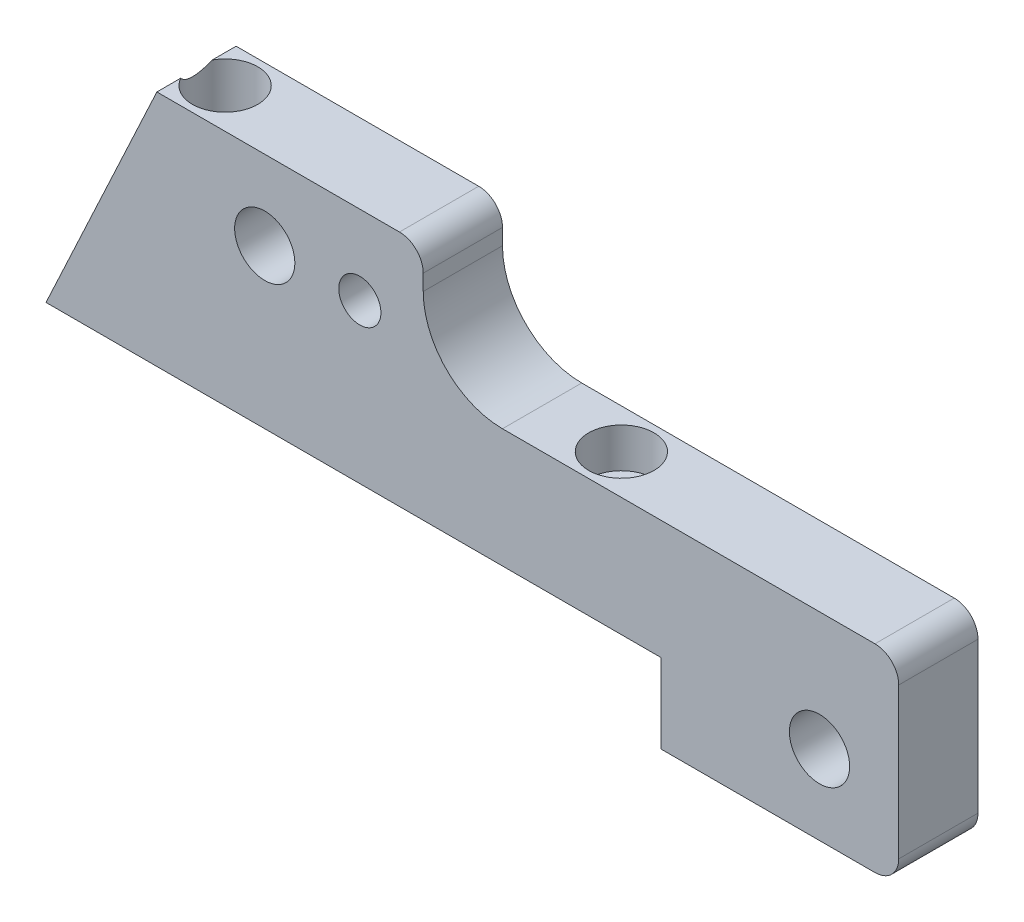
ISO-10303-21;
HEADER;
FILE_DESCRIPTION(('STEP AP214'),'2;1');
FILE_NAME('part.step','',(''),(''),'','','');
FILE_SCHEMA(('AUTOMOTIVE_DESIGN { 1 0 10303 214 1 1 1 1 }'));
ENDSEC;
DATA;
#1=APPLICATION_CONTEXT('core data for automotive mechanical design processes');
#2=APPLICATION_PROTOCOL_DEFINITION('international standard','automotive_design',2000,#1);
#3=PRODUCT_CONTEXT('',#1,'mechanical');
#4=PRODUCT('Part','Part','',(#3));
#5=PRODUCT_RELATED_PRODUCT_CATEGORY('part','',(#4));
#6=PRODUCT_DEFINITION_FORMATION('','',#4);
#7=PRODUCT_DEFINITION_CONTEXT('part definition',#1,'design');
#8=PRODUCT_DEFINITION('design','',#6,#7);
#9=PRODUCT_DEFINITION_SHAPE('','',#8);
#10=(LENGTH_UNIT() NAMED_UNIT(*) SI_UNIT(.MILLI.,.METRE.));
#11=(NAMED_UNIT(*) PLANE_ANGLE_UNIT() SI_UNIT($,.RADIAN.));
#12=(NAMED_UNIT(*) SI_UNIT($,.STERADIAN.) SOLID_ANGLE_UNIT());
#13=UNCERTAINTY_MEASURE_WITH_UNIT(LENGTH_MEASURE(1.E-05),#10,'distance_accuracy_value','');
#14=(GEOMETRIC_REPRESENTATION_CONTEXT(3) GLOBAL_UNCERTAINTY_ASSIGNED_CONTEXT((#13)) GLOBAL_UNIT_ASSIGNED_CONTEXT((#10,
#11,#12)) REPRESENTATION_CONTEXT('',''));
#15=CARTESIAN_POINT('',(0.,0.,0.));
#16=DIRECTION('',(0.,0.,1.));
#17=DIRECTION('',(1.,0.,0.));
#18=AXIS2_PLACEMENT_3D('',#15,#16,#17);
#19=CARTESIAN_POINT('',(-41.91,34.29,6.35));
#20=DIRECTION('',(0.,0.,-1.));
#21=DIRECTION('',(-1.,0.,0.));
#22=AXIS2_PLACEMENT_3D('',#19,#20,#21);
#23=PLANE('',#22);
#24=CARTESIAN_POINT('',(-48.26,25.4,6.35));
#25=DIRECTION('',(0.,0.,-1.));
#26=DIRECTION('',(-1.,0.,0.));
#27=AXIS2_PLACEMENT_3D('',#24,#25,#26);
#28=CIRCLE('',#27,3.3782);
#29=CARTESIAN_POINT('',(-51.6382,25.4,6.35));
#30=VERTEX_POINT('',#29);
#31=EDGE_CURVE('E48',#30,#30,#28,.T.);
#32=ORIENTED_EDGE('',*,*,#31,.T.);
#33=EDGE_LOOP('',(#32));
#34=FACE_BOUND('',#33,.T.);
#35=DIRECTION('',(0.,-1.,0.));
#36=VECTOR('',#35,1.);
#37=CARTESIAN_POINT('',(0.,-12.7,6.35));
#38=LINE('',#37,#36);
#39=CARTESIAN_POINT('',(0.,0.,6.35));
#40=VERTEX_POINT('',#39);
#41=CARTESIAN_POINT('',(0.,-12.7,6.35));
#42=VERTEX_POINT('',#41);
#43=EDGE_CURVE('E201',#40,#42,#38,.T.);
#44=ORIENTED_EDGE('',*,*,#43,.T.);
#45=DIRECTION('',(1.,0.,0.));
#46=VECTOR('',#45,1.);
#47=CARTESIAN_POINT('',(34.29,-12.7,6.35));
#48=LINE('',#47,#46);
#49=CARTESIAN_POINT('',(34.29,-12.7,6.35));
#50=VERTEX_POINT('',#49);
#51=EDGE_CURVE('E122',#42,#50,#48,.T.);
#52=ORIENTED_EDGE('',*,*,#51,.T.);
#53=CARTESIAN_POINT('',(34.29,-8.89,6.35));
#54=DIRECTION('',(0.,0.,1.));
#55=DIRECTION('',(-1.,0.,0.));
#56=AXIS2_PLACEMENT_3D('',#53,#54,#55);
#57=CIRCLE('',#56,3.81);
#58=CARTESIAN_POINT('',(38.1,-8.89,6.35));
#59=VERTEX_POINT('',#58);
#60=EDGE_CURVE('E264',#50,#59,#57,.T.);
#61=ORIENTED_EDGE('',*,*,#60,.T.);
#62=DIRECTION('',(0.,1.,0.));
#63=VECTOR('',#62,1.);
#64=CARTESIAN_POINT('',(38.1,15.24,6.35));
#65=LINE('',#64,#63);
#66=CARTESIAN_POINT('',(38.1,15.24,6.35));
#67=VERTEX_POINT('',#66);
#68=EDGE_CURVE('E266',#59,#67,#65,.T.);
#69=ORIENTED_EDGE('',*,*,#68,.T.);
#70=CARTESIAN_POINT('',(34.29,15.24,6.35));
#71=DIRECTION('',(0.,0.,1.));
#72=DIRECTION('',(-1.,0.,0.));
#73=AXIS2_PLACEMENT_3D('',#70,#71,#72);
#74=CIRCLE('',#73,3.81);
#75=CARTESIAN_POINT('',(34.29,19.05,6.35));
#76=VERTEX_POINT('',#75);
#77=EDGE_CURVE('E268',#67,#76,#74,.T.);
#78=ORIENTED_EDGE('',*,*,#77,.T.);
#79=DIRECTION('',(-1.,0.,0.));
#80=VECTOR('',#79,1.);
#81=CARTESIAN_POINT('',(-25.4,19.05,6.35));
#82=LINE('',#81,#80);
#83=CARTESIAN_POINT('',(-25.4,19.05,6.35));
#84=VERTEX_POINT('',#83);
#85=EDGE_CURVE('E270',#76,#84,#82,.T.);
#86=ORIENTED_EDGE('',*,*,#85,.T.);
#87=CARTESIAN_POINT('',(-25.4,31.75,6.35));
#88=DIRECTION('',(0.,0.,-1.));
#89=DIRECTION('',(1.,0.,0.));
#90=AXIS2_PLACEMENT_3D('',#87,#88,#89);
#91=CIRCLE('',#90,12.7);
#92=CARTESIAN_POINT('',(-38.1,31.75,6.35));
#93=VERTEX_POINT('',#92);
#94=EDGE_CURVE('E272',#84,#93,#91,.T.);
#95=ORIENTED_EDGE('',*,*,#94,.T.);
#96=DIRECTION('',(0.,1.,0.));
#97=VECTOR('',#96,1.);
#98=CARTESIAN_POINT('',(-38.1,34.29,6.35));
#99=LINE('',#98,#97);
#100=CARTESIAN_POINT('',(-38.1,34.29,6.35));
#101=VERTEX_POINT('',#100);
#102=EDGE_CURVE('E274',#93,#101,#99,.T.);
#103=ORIENTED_EDGE('',*,*,#102,.T.);
#104=CARTESIAN_POINT('',(-41.91,34.29,6.35));
#105=DIRECTION('',(0.,0.,1.));
#106=DIRECTION('',(-1.,0.,0.));
#107=AXIS2_PLACEMENT_3D('',#104,#105,#106);
#108=CIRCLE('',#107,3.81);
#109=CARTESIAN_POINT('',(-41.91,38.1,6.35));
#110=VERTEX_POINT('',#109);
#111=EDGE_CURVE('E155',#101,#110,#108,.T.);
#112=ORIENTED_EDGE('',*,*,#111,.T.);
#113=DIRECTION('',(-1.,0.,0.));
#114=VECTOR('',#113,1.);
#115=CARTESIAN_POINT('',(-80.7856782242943,38.1,6.35));
#116=LINE('',#115,#114);
#117=CARTESIAN_POINT('',(-80.7856782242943,38.1,6.35));
#118=VERTEX_POINT('',#117);
#119=EDGE_CURVE('E148',#110,#118,#116,.T.);
#120=ORIENTED_EDGE('',*,*,#119,.T.);
#121=DIRECTION('',(-0.422618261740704,-0.906307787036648,0.));
#122=VECTOR('',#121,1.);
#123=CARTESIAN_POINT('',(-98.552,0.,6.35));
#124=LINE('',#123,#122);
#125=CARTESIAN_POINT('',(-98.552,0.,6.35));
#126=VERTEX_POINT('',#125);
#127=EDGE_CURVE('E152',#118,#126,#124,.T.);
#128=ORIENTED_EDGE('',*,*,#127,.T.);
#129=DIRECTION('',(1.,0.,0.));
#130=VECTOR('',#129,1.);
#131=CARTESIAN_POINT('',(0.,0.,6.35));
#132=LINE('',#131,#130);
#133=EDGE_CURVE('E68',#126,#40,#132,.T.);
#134=ORIENTED_EDGE('',*,*,#133,.T.);
#135=EDGE_LOOP('',(#44,#52,#61,#69,#78,#86,#95,#103,#112,#120,#128,#134));
#136=FACE_BOUND('',#135,.T.);
#137=CARTESIAN_POINT('',(-63.5,25.4,6.35));
#138=DIRECTION('',(0.,0.,1.));
#139=DIRECTION('',(1.,0.,0.));
#140=AXIS2_PLACEMENT_3D('',#137,#138,#139);
#141=CIRCLE('',#140,4.826);
#142=CARTESIAN_POINT('',(-58.674,25.4,6.35));
#143=VERTEX_POINT('',#142);
#144=EDGE_CURVE('E179',#143,#143,#141,.T.);
#145=ORIENTED_EDGE('',*,*,#144,.F.);
#146=EDGE_LOOP('',(#145));
#147=FACE_BOUND('',#146,.T.);
#148=CARTESIAN_POINT('',(25.4,0.,6.35));
#149=DIRECTION('',(0.,0.,1.));
#150=DIRECTION('',(1.,0.,0.));
#151=AXIS2_PLACEMENT_3D('',#148,#149,#150);
#152=CIRCLE('',#151,4.826);
#153=CARTESIAN_POINT('',(30.226,0.,6.35));
#154=VERTEX_POINT('',#153);
#155=EDGE_CURVE('E252',#154,#154,#152,.T.);
#156=ORIENTED_EDGE('',*,*,#155,.F.);
#157=EDGE_LOOP('',(#156));
#158=FACE_BOUND('',#157,.T.);
#159=ADVANCED_FACE('F44',(#34,#136,#147,#158),#23,.F.);
#160=CARTESIAN_POINT('',(-41.91,34.29,-6.35));
#161=DIRECTION('',(0.,0.,-1.));
#162=DIRECTION('',(-1.,0.,0.));
#163=AXIS2_PLACEMENT_3D('',#160,#161,#162);
#164=PLANE('',#163);
#165=CARTESIAN_POINT('',(-48.26,25.4,-6.35));
#166=DIRECTION('',(0.,0.,-1.));
#167=DIRECTION('',(-1.,0.,0.));
#168=AXIS2_PLACEMENT_3D('',#165,#166,#167);
#169=CIRCLE('',#168,6.74623999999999);
#170=CARTESIAN_POINT('',(-55.00624,25.4,-6.35));
#171=VERTEX_POINT('',#170);
#172=EDGE_CURVE('E548',#171,#171,#169,.T.);
#173=ORIENTED_EDGE('',*,*,#172,.F.);
#174=EDGE_LOOP('',(#173));
#175=FACE_BOUND('',#174,.T.);
#176=CARTESIAN_POINT('',(-63.5,25.4,-6.35));
#177=DIRECTION('',(0.,0.,1.));
#178=DIRECTION('',(1.,0.,0.));
#179=AXIS2_PLACEMENT_3D('',#176,#177,#178);
#180=CIRCLE('',#179,4.826);
#181=CARTESIAN_POINT('',(-58.674,25.4,-6.35));
#182=VERTEX_POINT('',#181);
#183=EDGE_CURVE('E255',#182,#182,#180,.T.);
#184=ORIENTED_EDGE('',*,*,#183,.T.);
#185=EDGE_LOOP('',(#184));
#186=FACE_BOUND('',#185,.T.);
#187=DIRECTION('',(0.,-1.,0.));
#188=VECTOR('',#187,1.);
#189=CARTESIAN_POINT('',(0.,-12.7,-6.35));
#190=LINE('',#189,#188);
#191=CARTESIAN_POINT('',(0.,0.,-6.35));
#192=VERTEX_POINT('',#191);
#193=CARTESIAN_POINT('',(0.,-12.7,-6.35));
#194=VERTEX_POINT('',#193);
#195=EDGE_CURVE('E175',#192,#194,#190,.T.);
#196=ORIENTED_EDGE('',*,*,#195,.F.);
#197=DIRECTION('',(1.,0.,0.));
#198=VECTOR('',#197,1.);
#199=CARTESIAN_POINT('',(0.,0.,-6.35));
#200=LINE('',#199,#198);
#201=CARTESIAN_POINT('',(-98.552,0.,-6.35));
#202=VERTEX_POINT('',#201);
#203=EDGE_CURVE('E113',#202,#192,#200,.T.);
#204=ORIENTED_EDGE('',*,*,#203,.F.);
#205=DIRECTION('',(-0.422618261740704,-0.906307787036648,0.));
#206=VECTOR('',#205,1.);
#207=CARTESIAN_POINT('',(-98.552,0.,-6.35));
#208=LINE('',#207,#206);
#209=CARTESIAN_POINT('',(-80.7856782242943,38.1,-6.35));
#210=VERTEX_POINT('',#209);
#211=EDGE_CURVE('E198',#210,#202,#208,.T.);
#212=ORIENTED_EDGE('',*,*,#211,.F.);
#213=DIRECTION('',(-1.,0.,0.));
#214=VECTOR('',#213,1.);
#215=CARTESIAN_POINT('',(-80.7856782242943,38.1,-6.35));
#216=LINE('',#215,#214);
#217=CARTESIAN_POINT('',(-41.91,38.1,-6.35));
#218=VERTEX_POINT('',#217);
#219=EDGE_CURVE('E195',#218,#210,#216,.T.);
#220=ORIENTED_EDGE('',*,*,#219,.F.);
#221=CARTESIAN_POINT('',(-41.91,34.29,-6.35));
#222=DIRECTION('',(0.,0.,1.));
#223=DIRECTION('',(-1.,0.,0.));
#224=AXIS2_PLACEMENT_3D('',#221,#222,#223);
#225=CIRCLE('',#224,3.81);
#226=CARTESIAN_POINT('',(-38.1,34.29,-6.35));
#227=VERTEX_POINT('',#226);
#228=EDGE_CURVE('E193',#227,#218,#225,.T.);
#229=ORIENTED_EDGE('',*,*,#228,.F.);
#230=DIRECTION('',(0.,1.,0.));
#231=VECTOR('',#230,1.);
#232=CARTESIAN_POINT('',(-38.1,34.29,-6.35));
#233=LINE('',#232,#231);
#234=CARTESIAN_POINT('',(-38.1,31.75,-6.35));
#235=VERTEX_POINT('',#234);
#236=EDGE_CURVE('E191',#235,#227,#233,.T.);
#237=ORIENTED_EDGE('',*,*,#236,.F.);
#238=CARTESIAN_POINT('',(-25.4,31.75,-6.35));
#239=DIRECTION('',(0.,0.,-1.));
#240=DIRECTION('',(1.,0.,0.));
#241=AXIS2_PLACEMENT_3D('',#238,#239,#240);
#242=CIRCLE('',#241,12.7);
#243=CARTESIAN_POINT('',(-25.4,19.05,-6.35));
#244=VERTEX_POINT('',#243);
#245=EDGE_CURVE('E189',#244,#235,#242,.T.);
#246=ORIENTED_EDGE('',*,*,#245,.F.);
#247=DIRECTION('',(-1.,0.,0.));
#248=VECTOR('',#247,1.);
#249=CARTESIAN_POINT('',(-25.4,19.05,-6.35));
#250=LINE('',#249,#248);
#251=CARTESIAN_POINT('',(34.29,19.05,-6.35));
#252=VERTEX_POINT('',#251);
#253=EDGE_CURVE('E187',#252,#244,#250,.T.);
#254=ORIENTED_EDGE('',*,*,#253,.F.);
#255=CARTESIAN_POINT('',(34.29,15.24,-6.35));
#256=DIRECTION('',(0.,0.,1.));
#257=DIRECTION('',(-1.,0.,0.));
#258=AXIS2_PLACEMENT_3D('',#255,#256,#257);
#259=CIRCLE('',#258,3.81);
#260=CARTESIAN_POINT('',(38.1,15.24,-6.35));
#261=VERTEX_POINT('',#260);
#262=EDGE_CURVE('E185',#261,#252,#259,.T.);
#263=ORIENTED_EDGE('',*,*,#262,.F.);
#264=DIRECTION('',(0.,1.,0.));
#265=VECTOR('',#264,1.);
#266=CARTESIAN_POINT('',(38.1,15.24,-6.35));
#267=LINE('',#266,#265);
#268=CARTESIAN_POINT('',(38.1,-8.89,-6.35));
#269=VERTEX_POINT('',#268);
#270=EDGE_CURVE('E183',#269,#261,#267,.T.);
#271=ORIENTED_EDGE('',*,*,#270,.F.);
#272=CARTESIAN_POINT('',(34.29,-8.89,-6.35));
#273=DIRECTION('',(0.,0.,1.));
#274=DIRECTION('',(-1.,0.,0.));
#275=AXIS2_PLACEMENT_3D('',#272,#273,#274);
#276=CIRCLE('',#275,3.81);
#277=CARTESIAN_POINT('',(34.29,-12.7,-6.35));
#278=VERTEX_POINT('',#277);
#279=EDGE_CURVE('E181',#278,#269,#276,.T.);
#280=ORIENTED_EDGE('',*,*,#279,.F.);
#281=DIRECTION('',(1.,0.,0.));
#282=VECTOR('',#281,1.);
#283=CARTESIAN_POINT('',(34.29,-12.7,-6.35));
#284=LINE('',#283,#282);
#285=EDGE_CURVE('E178',#194,#278,#284,.T.);
#286=ORIENTED_EDGE('',*,*,#285,.F.);
#287=EDGE_LOOP('',(#196,#204,#212,#220,#229,#237,#246,#254,#263,#271,#280,#286));
#288=FACE_BOUND('',#287,.T.);
#289=CARTESIAN_POINT('',(25.4,0.,-6.35));
#290=DIRECTION('',(0.,0.,1.));
#291=DIRECTION('',(1.,0.,0.));
#292=AXIS2_PLACEMENT_3D('',#289,#290,#291);
#293=CIRCLE('',#292,4.826);
#294=CARTESIAN_POINT('',(30.226,0.,-6.35));
#295=VERTEX_POINT('',#294);
#296=EDGE_CURVE('E229',#295,#295,#293,.T.);
#297=ORIENTED_EDGE('',*,*,#296,.T.);
#298=EDGE_LOOP('',(#297));
#299=FACE_BOUND('',#298,.T.);
#300=ADVANCED_FACE('F289',(#175,#186,#288,#299),#164,.T.);
#301=CARTESIAN_POINT('',(0.,-12.7,6.35));
#302=DIRECTION('',(1.,0.,0.));
#303=DIRECTION('',(0.,0.,-1.));
#304=AXIS2_PLACEMENT_3D('',#301,#302,#303);
#305=PLANE('',#304);
#306=ORIENTED_EDGE('',*,*,#195,.T.);
#307=DIRECTION('',(0.,0.,-1.));
#308=VECTOR('',#307,1.);
#309=CARTESIAN_POINT('',(0.,-12.7,6.35));
#310=LINE('',#309,#308);
#311=EDGE_CURVE('E53',#42,#194,#310,.T.);
#312=ORIENTED_EDGE('',*,*,#311,.F.);
#313=ORIENTED_EDGE('',*,*,#43,.F.);
#314=DIRECTION('',(0.,0.,-1.));
#315=VECTOR('',#314,1.);
#316=CARTESIAN_POINT('',(0.,0.,6.35));
#317=LINE('',#316,#315);
#318=EDGE_CURVE('E171',#40,#192,#317,.T.);
#319=ORIENTED_EDGE('',*,*,#318,.T.);
#320=EDGE_LOOP('',(#306,#312,#313,#319));
#321=FACE_BOUND('',#320,.T.);
#322=ADVANCED_FACE('F46',(#321),#305,.F.);
#323=CARTESIAN_POINT('',(34.29,-12.7,6.35));
#324=DIRECTION('',(0.,1.,0.));
#325=DIRECTION('',(-1.,0.,0.));
#326=AXIS2_PLACEMENT_3D('',#323,#324,#325);
#327=PLANE('',#326);
#328=ORIENTED_EDGE('',*,*,#285,.T.);
#329=DIRECTION('',(0.,0.,-1.));
#330=VECTOR('',#329,1.);
#331=CARTESIAN_POINT('',(34.29,-12.7,6.35));
#332=LINE('',#331,#330);
#333=EDGE_CURVE('E223',#50,#278,#332,.T.);
#334=ORIENTED_EDGE('',*,*,#333,.F.);
#335=ORIENTED_EDGE('',*,*,#51,.F.);
#336=ORIENTED_EDGE('',*,*,#311,.T.);
#337=EDGE_LOOP('',(#328,#334,#335,#336));
#338=FACE_BOUND('',#337,.T.);
#339=ADVANCED_FACE('F297',(#338),#327,.F.);
#340=CARTESIAN_POINT('',(34.29,-8.89,6.35));
#341=DIRECTION('',(0.,0.,-1.));
#342=DIRECTION('',(-1.,0.,0.));
#343=AXIS2_PLACEMENT_3D('',#340,#341,#342);
#344=CYLINDRICAL_SURFACE('',#343,3.81);
#345=ORIENTED_EDGE('',*,*,#279,.T.);
#346=DIRECTION('',(0.,0.,-1.));
#347=VECTOR('',#346,1.);
#348=CARTESIAN_POINT('',(38.1,-8.89,6.35));
#349=LINE('',#348,#347);
#350=EDGE_CURVE('E220',#59,#269,#349,.T.);
#351=ORIENTED_EDGE('',*,*,#350,.F.);
#352=ORIENTED_EDGE('',*,*,#60,.F.);
#353=ORIENTED_EDGE('',*,*,#333,.T.);
#354=EDGE_LOOP('',(#345,#351,#352,#353));
#355=FACE_BOUND('',#354,.T.);
#356=ADVANCED_FACE('F300',(#355),#344,.T.);
#357=CARTESIAN_POINT('',(38.1,15.24,6.35));
#358=DIRECTION('',(-1.,0.,0.));
#359=DIRECTION('',(0.,-1.,0.));
#360=AXIS2_PLACEMENT_3D('',#357,#358,#359);
#361=PLANE('',#360);
#362=ORIENTED_EDGE('',*,*,#270,.T.);
#363=DIRECTION('',(0.,0.,-1.));
#364=VECTOR('',#363,1.);
#365=CARTESIAN_POINT('',(38.1,15.24,6.35));
#366=LINE('',#365,#364);
#367=EDGE_CURVE('E217',#67,#261,#366,.T.);
#368=ORIENTED_EDGE('',*,*,#367,.F.);
#369=ORIENTED_EDGE('',*,*,#68,.F.);
#370=ORIENTED_EDGE('',*,*,#350,.T.);
#371=EDGE_LOOP('',(#362,#368,#369,#370));
#372=FACE_BOUND('',#371,.T.);
#373=ADVANCED_FACE('F305',(#372),#361,.F.);
#374=CARTESIAN_POINT('',(34.29,15.24,6.35));
#375=DIRECTION('',(0.,0.,-1.));
#376=DIRECTION('',(-1.,0.,0.));
#377=AXIS2_PLACEMENT_3D('',#374,#375,#376);
#378=CYLINDRICAL_SURFACE('',#377,3.81);
#379=ORIENTED_EDGE('',*,*,#262,.T.);
#380=DIRECTION('',(0.,0.,-1.));
#381=VECTOR('',#380,1.);
#382=CARTESIAN_POINT('',(34.29,19.05,6.35));
#383=LINE('',#382,#381);
#384=EDGE_CURVE('E214',#76,#252,#383,.T.);
#385=ORIENTED_EDGE('',*,*,#384,.F.);
#386=ORIENTED_EDGE('',*,*,#77,.F.);
#387=ORIENTED_EDGE('',*,*,#367,.T.);
#388=EDGE_LOOP('',(#379,#385,#386,#387));
#389=FACE_BOUND('',#388,.T.);
#390=ADVANCED_FACE('F311',(#389),#378,.T.);
#391=CARTESIAN_POINT('',(-25.4,19.05,6.35));
#392=DIRECTION('',(0.,-1.,0.));
#393=DIRECTION('',(1.,0.,0.));
#394=AXIS2_PLACEMENT_3D('',#391,#392,#393);
#395=PLANE('',#394);
#396=CARTESIAN_POINT('',(-12.7,19.05,0.));
#397=DIRECTION('',(0.,1.,0.));
#398=DIRECTION('',(0.,0.,1.));
#399=AXIS2_PLACEMENT_3D('',#396,#397,#398);
#400=CIRCLE('',#399,5.23239999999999);
#401=CARTESIAN_POINT('',(-12.7,19.05,5.23239999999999));
#402=VERTEX_POINT('',#401);
#403=EDGE_CURVE('E244',#402,#402,#400,.T.);
#404=ORIENTED_EDGE('',*,*,#403,.F.);
#405=EDGE_LOOP('',(#404));
#406=FACE_BOUND('',#405,.T.);
#407=ORIENTED_EDGE('',*,*,#253,.T.);
#408=DIRECTION('',(0.,0.,-1.));
#409=VECTOR('',#408,1.);
#410=CARTESIAN_POINT('',(-25.4,19.05,6.35));
#411=LINE('',#410,#409);
#412=EDGE_CURVE('E211',#84,#244,#411,.T.);
#413=ORIENTED_EDGE('',*,*,#412,.F.);
#414=ORIENTED_EDGE('',*,*,#85,.F.);
#415=ORIENTED_EDGE('',*,*,#384,.T.);
#416=EDGE_LOOP('',(#407,#413,#414,#415));
#417=FACE_BOUND('',#416,.T.);
#418=ADVANCED_FACE('F315',(#406,#417),#395,.F.);
#419=CARTESIAN_POINT('',(-25.4,31.75,6.35));
#420=DIRECTION('',(0.,0.,-1.));
#421=DIRECTION('',(-1.,0.,0.));
#422=AXIS2_PLACEMENT_3D('',#419,#420,#421);
#423=CYLINDRICAL_SURFACE('',#422,12.7);
#424=ORIENTED_EDGE('',*,*,#245,.T.);
#425=DIRECTION('',(0.,0.,-1.));
#426=VECTOR('',#425,1.);
#427=CARTESIAN_POINT('',(-38.1,31.75,6.35));
#428=LINE('',#427,#426);
#429=EDGE_CURVE('E208',#93,#235,#428,.T.);
#430=ORIENTED_EDGE('',*,*,#429,.F.);
#431=ORIENTED_EDGE('',*,*,#94,.F.);
#432=ORIENTED_EDGE('',*,*,#412,.T.);
#433=EDGE_LOOP('',(#424,#430,#431,#432));
#434=FACE_BOUND('',#433,.T.);
#435=ADVANCED_FACE('F318',(#434),#423,.F.);
#436=CARTESIAN_POINT('',(-38.1,34.29,6.35));
#437=DIRECTION('',(-1.,0.,0.));
#438=DIRECTION('',(0.,-1.,0.));
#439=AXIS2_PLACEMENT_3D('',#436,#437,#438);
#440=PLANE('',#439);
#441=ORIENTED_EDGE('',*,*,#236,.T.);
#442=DIRECTION('',(0.,0.,-1.));
#443=VECTOR('',#442,1.);
#444=CARTESIAN_POINT('',(-38.1,34.29,6.35));
#445=LINE('',#444,#443);
#446=EDGE_CURVE('E205',#101,#227,#445,.T.);
#447=ORIENTED_EDGE('',*,*,#446,.F.);
#448=ORIENTED_EDGE('',*,*,#102,.F.);
#449=ORIENTED_EDGE('',*,*,#429,.T.);
#450=EDGE_LOOP('',(#441,#447,#448,#449));
#451=FACE_BOUND('',#450,.T.);
#452=ADVANCED_FACE('F280',(#451),#440,.F.);
#453=CARTESIAN_POINT('',(-41.91,34.29,6.35));
#454=DIRECTION('',(0.,0.,-1.));
#455=DIRECTION('',(-1.,0.,0.));
#456=AXIS2_PLACEMENT_3D('',#453,#454,#455);
#457=CYLINDRICAL_SURFACE('',#456,3.81);
#458=ORIENTED_EDGE('',*,*,#228,.T.);
#459=DIRECTION('',(0.,0.,-1.));
#460=VECTOR('',#459,1.);
#461=CARTESIAN_POINT('',(-41.91,38.1,6.35));
#462=LINE('',#461,#460);
#463=EDGE_CURVE('E165',#110,#218,#462,.T.);
#464=ORIENTED_EDGE('',*,*,#463,.F.);
#465=ORIENTED_EDGE('',*,*,#111,.F.);
#466=ORIENTED_EDGE('',*,*,#446,.T.);
#467=EDGE_LOOP('',(#458,#464,#465,#466));
#468=FACE_BOUND('',#467,.T.);
#469=ADVANCED_FACE('F284',(#468),#457,.T.);
#470=CARTESIAN_POINT('',(-80.7856782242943,38.1,6.35));
#471=DIRECTION('',(0.,-1.,0.));
#472=DIRECTION('',(0.,0.,-1.));
#473=AXIS2_PLACEMENT_3D('',#470,#471,#472);
#474=PLANE('',#473);
#475=DIRECTION('',(0.,0.,-1.));
#476=VECTOR('',#475,1.);
#477=CARTESIAN_POINT('',(-80.7856782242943,38.1,6.35));
#478=LINE('',#477,#476);
#479=CARTESIAN_POINT('',(-80.7856782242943,38.1,-2.51983431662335));
#480=VERTEX_POINT('',#479);
#481=EDGE_CURVE('E166',#480,#210,#478,.T.);
#482=ORIENTED_EDGE('',*,*,#481,.F.);
#483=CARTESIAN_POINT('',(-76.2,38.1,0.));
#484=DIRECTION('',(0.,1.,0.));
#485=DIRECTION('',(0.,0.,1.));
#486=AXIS2_PLACEMENT_3D('',#483,#484,#485);
#487=CIRCLE('',#486,5.2324);
#488=CARTESIAN_POINT('',(-80.7856782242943,38.1,2.51983431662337));
#489=VERTEX_POINT('',#488);
#490=EDGE_CURVE('E60',#489,#480,#487,.T.);
#491=ORIENTED_EDGE('',*,*,#490,.F.);
#492=EDGE_CURVE('E161',#118,#489,#478,.T.);
#493=ORIENTED_EDGE('',*,*,#492,.F.);
#494=ORIENTED_EDGE('',*,*,#119,.F.);
#495=ORIENTED_EDGE('',*,*,#463,.T.);
#496=ORIENTED_EDGE('',*,*,#219,.T.);
#497=EDGE_LOOP('',(#482,#491,#493,#494,#495,#496));
#498=FACE_BOUND('',#497,.T.);
#499=ADVANCED_FACE('F163',(#498),#474,.F.);
#500=CARTESIAN_POINT('',(-98.552,0.,6.35));
#501=DIRECTION('',(0.906307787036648,-0.422618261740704,0.));
#502=DIRECTION('',(0.422618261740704,0.906307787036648,0.));
#503=AXIS2_PLACEMENT_3D('',#500,#501,#502);
#504=PLANE('',#503);
#505=ORIENTED_EDGE('',*,*,#492,.T.);
#506=CARTESIAN_POINT('',(-76.2,47.9340186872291,0.));
#507=DIRECTION('',(0.906307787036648,-0.422618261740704,0.));
#508=DIRECTION('',(0.422618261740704,0.906307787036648,0.));
#509=AXIS2_PLACEMENT_3D('',#506,#507,#508);
#510=ELLIPSE('',#509,12.380913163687,5.2324);
#511=EDGE_CURVE('E13',#489,#480,#510,.T.);
#512=ORIENTED_EDGE('',*,*,#511,.T.);
#513=ORIENTED_EDGE('',*,*,#481,.T.);
#514=ORIENTED_EDGE('',*,*,#211,.T.);
#515=DIRECTION('',(0.,0.,-1.));
#516=VECTOR('',#515,1.);
#517=CARTESIAN_POINT('',(-98.552,0.,6.35));
#518=LINE('',#517,#516);
#519=EDGE_CURVE('E169',#126,#202,#518,.T.);
#520=ORIENTED_EDGE('',*,*,#519,.F.);
#521=ORIENTED_EDGE('',*,*,#127,.F.);
#522=EDGE_LOOP('',(#505,#512,#513,#514,#520,#521));
#523=FACE_BOUND('',#522,.T.);
#524=ADVANCED_FACE('F168',(#523),#504,.F.);
#525=CARTESIAN_POINT('',(0.,0.,6.35));
#526=DIRECTION('',(0.,1.,0.));
#527=DIRECTION('',(-1.,0.,0.));
#528=AXIS2_PLACEMENT_3D('',#525,#526,#527);
#529=PLANE('',#528);
#530=CARTESIAN_POINT('',(-12.7,0.,0.));
#531=DIRECTION('',(0.,1.,0.));
#532=DIRECTION('',(-1.,0.,0.));
#533=AXIS2_PLACEMENT_3D('',#530,#531,#532);
#534=CIRCLE('',#533,3.37819999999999);
#535=CARTESIAN_POINT('',(-16.0782,0.,0.));
#536=VERTEX_POINT('',#535);
#537=EDGE_CURVE('E231',#536,#536,#534,.T.);
#538=ORIENTED_EDGE('',*,*,#537,.T.);
#539=EDGE_LOOP('',(#538));
#540=FACE_BOUND('',#539,.T.);
#541=CARTESIAN_POINT('',(-76.2,0.,0.));
#542=DIRECTION('',(0.,1.,0.));
#543=DIRECTION('',(-1.,0.,0.));
#544=AXIS2_PLACEMENT_3D('',#541,#542,#543);
#545=CIRCLE('',#544,3.37819999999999);
#546=CARTESIAN_POINT('',(-79.5782,0.,0.));
#547=VERTEX_POINT('',#546);
#548=EDGE_CURVE('E227',#547,#547,#545,.T.);
#549=ORIENTED_EDGE('',*,*,#548,.T.);
#550=EDGE_LOOP('',(#549));
#551=FACE_BOUND('',#550,.T.);
#552=ORIENTED_EDGE('',*,*,#203,.T.);
#553=ORIENTED_EDGE('',*,*,#318,.F.);
#554=ORIENTED_EDGE('',*,*,#133,.F.);
#555=ORIENTED_EDGE('',*,*,#519,.T.);
#556=EDGE_LOOP('',(#552,#553,#554,#555));
#557=FACE_BOUND('',#556,.T.);
#558=ADVANCED_FACE('F291',(#540,#551,#557),#529,.F.);
#559=CARTESIAN_POINT('',(-63.5,25.4,6.35));
#560=DIRECTION('',(0.,0.,-1.));
#561=DIRECTION('',(-1.,0.,0.));
#562=AXIS2_PLACEMENT_3D('',#559,#560,#561);
#563=CYLINDRICAL_SURFACE('',#562,4.826);
#564=ORIENTED_EDGE('',*,*,#144,.T.);
#565=EDGE_LOOP('',(#564));
#566=FACE_BOUND('',#565,.T.);
#567=ORIENTED_EDGE('',*,*,#183,.F.);
#568=EDGE_LOOP('',(#567));
#569=FACE_BOUND('',#568,.T.);
#570=ADVANCED_FACE('F338',(#566,#569),#563,.F.);
#571=CARTESIAN_POINT('',(25.4,0.,6.35));
#572=DIRECTION('',(0.,0.,-1.));
#573=DIRECTION('',(-1.,0.,0.));
#574=AXIS2_PLACEMENT_3D('',#571,#572,#573);
#575=CYLINDRICAL_SURFACE('',#574,4.826);
#576=ORIENTED_EDGE('',*,*,#155,.T.);
#577=EDGE_LOOP('',(#576));
#578=FACE_BOUND('',#577,.T.);
#579=ORIENTED_EDGE('',*,*,#296,.F.);
#580=EDGE_LOOP('',(#579));
#581=FACE_BOUND('',#580,.T.);
#582=ADVANCED_FACE('F374',(#578,#581),#575,.F.);
#583=CARTESIAN_POINT('',(-76.2,38.1,0.));
#584=DIRECTION('',(0.,1.,0.));
#585=DIRECTION('',(0.,0.,1.));
#586=AXIS2_PLACEMENT_3D('',#583,#584,#585);
#587=CYLINDRICAL_SURFACE('',#586,3.37819999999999);
#588=CARTESIAN_POINT('',(-76.2,19.05,0.));
#589=DIRECTION('',(0.,1.,0.));
#590=DIRECTION('',(0.,0.,1.));
#591=AXIS2_PLACEMENT_3D('',#588,#589,#590);
#592=CIRCLE('',#591,3.3782);
#593=CARTESIAN_POINT('',(-76.2,19.05,3.3782));
#594=VERTEX_POINT('',#593);
#595=EDGE_CURVE('E230',#594,#594,#592,.T.);
#596=ORIENTED_EDGE('',*,*,#595,.T.);
#597=EDGE_LOOP('',(#596));
#598=FACE_BOUND('',#597,.T.);
#599=ORIENTED_EDGE('',*,*,#548,.F.);
#600=EDGE_LOOP('',(#599));
#601=FACE_BOUND('',#600,.T.);
#602=ADVANCED_FACE('F380',(#598,#601),#587,.F.);
#603=CARTESIAN_POINT('',(-76.2,38.1,0.));
#604=DIRECTION('',(0.,1.,0.));
#605=DIRECTION('',(0.,0.,1.));
#606=AXIS2_PLACEMENT_3D('',#603,#604,#605);
#607=CYLINDRICAL_SURFACE('',#606,5.2324);
#608=CARTESIAN_POINT('',(-76.2,19.05,0.));
#609=DIRECTION('',(0.,1.,0.));
#610=DIRECTION('',(0.,0.,1.));
#611=AXIS2_PLACEMENT_3D('',#608,#609,#610);
#612=CIRCLE('',#611,5.2324);
#613=CARTESIAN_POINT('',(-76.2,19.05,5.2324));
#614=VERTEX_POINT('',#613);
#615=EDGE_CURVE('E236',#614,#614,#612,.T.);
#616=ORIENTED_EDGE('',*,*,#615,.F.);
#617=EDGE_LOOP('',(#616));
#618=FACE_BOUND('',#617,.T.);
#619=ORIENTED_EDGE('',*,*,#490,.T.);
#620=ORIENTED_EDGE('',*,*,#511,.F.);
#621=EDGE_LOOP('',(#619,#620));
#622=FACE_BOUND('',#621,.T.);
#623=ADVANCED_FACE('F386',(#618,#622),#607,.F.);
#624=CARTESIAN_POINT('',(-72.8218,19.05,0.));
#625=DIRECTION('',(0.,-1.,0.));
#626=DIRECTION('',(0.,0.,-1.));
#627=AXIS2_PLACEMENT_3D('',#624,#625,#626);
#628=PLANE('',#627);
#629=ORIENTED_EDGE('',*,*,#595,.F.);
#630=EDGE_LOOP('',(#629));
#631=FACE_BOUND('',#630,.T.);
#632=ORIENTED_EDGE('',*,*,#615,.T.);
#633=EDGE_LOOP('',(#632));
#634=FACE_BOUND('',#633,.T.);
#635=ADVANCED_FACE('F394',(#631,#634),#628,.F.);
#636=CARTESIAN_POINT('',(-12.7,19.05,0.));
#637=DIRECTION('',(0.,1.,0.));
#638=DIRECTION('',(0.,0.,1.));
#639=AXIS2_PLACEMENT_3D('',#636,#637,#638);
#640=CYLINDRICAL_SURFACE('',#639,3.37819999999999);
#641=CARTESIAN_POINT('',(-12.7,12.7,0.));
#642=DIRECTION('',(0.,1.,0.));
#643=DIRECTION('',(0.,0.,1.));
#644=AXIS2_PLACEMENT_3D('',#641,#642,#643);
#645=CIRCLE('',#644,3.3782);
#646=CARTESIAN_POINT('',(-12.7,12.7,3.3782));
#647=VERTEX_POINT('',#646);
#648=EDGE_CURVE('E233',#647,#647,#645,.T.);
#649=ORIENTED_EDGE('',*,*,#648,.T.);
#650=EDGE_LOOP('',(#649));
#651=FACE_BOUND('',#650,.T.);
#652=ORIENTED_EDGE('',*,*,#537,.F.);
#653=EDGE_LOOP('',(#652));
#654=FACE_BOUND('',#653,.T.);
#655=ADVANCED_FACE('F402',(#651,#654),#640,.F.);
#656=CARTESIAN_POINT('',(-9.32179999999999,12.7,0.));
#657=DIRECTION('',(0.,-1.,0.));
#658=DIRECTION('',(0.,0.,-1.));
#659=AXIS2_PLACEMENT_3D('',#656,#657,#658);
#660=PLANE('',#659);
#661=ORIENTED_EDGE('',*,*,#648,.F.);
#662=EDGE_LOOP('',(#661));
#663=FACE_BOUND('',#662,.T.);
#664=CARTESIAN_POINT('',(-12.7,12.7,0.));
#665=DIRECTION('',(0.,1.,0.));
#666=DIRECTION('',(0.,0.,1.));
#667=AXIS2_PLACEMENT_3D('',#664,#665,#666);
#668=CIRCLE('',#667,5.2324);
#669=CARTESIAN_POINT('',(-12.7,12.7,5.2324));
#670=VERTEX_POINT('',#669);
#671=EDGE_CURVE('E239',#670,#670,#668,.T.);
#672=ORIENTED_EDGE('',*,*,#671,.T.);
#673=EDGE_LOOP('',(#672));
#674=FACE_BOUND('',#673,.T.);
#675=ADVANCED_FACE('F409',(#663,#674),#660,.F.);
#676=CARTESIAN_POINT('',(-12.7,19.05,0.));
#677=DIRECTION('',(0.,1.,0.));
#678=DIRECTION('',(0.,0.,1.));
#679=AXIS2_PLACEMENT_3D('',#676,#677,#678);
#680=CYLINDRICAL_SURFACE('',#679,5.2324);
#681=ORIENTED_EDGE('',*,*,#671,.F.);
#682=EDGE_LOOP('',(#681));
#683=FACE_BOUND('',#682,.T.);
#684=ORIENTED_EDGE('',*,*,#403,.T.);
#685=EDGE_LOOP('',(#684));
#686=FACE_BOUND('',#685,.T.);
#687=ADVANCED_FACE('F416',(#683,#686),#680,.F.);
#688=CARTESIAN_POINT('',(-48.26,25.4,-6.35));
#689=DIRECTION('',(0.,0.,-1.));
#690=DIRECTION('',(-1.,0.,0.));
#691=AXIS2_PLACEMENT_3D('',#688,#689,#690);
#692=CYLINDRICAL_SURFACE('',#691,3.3782);
#693=CARTESIAN_POINT('',(-48.26,25.4,0.));
#694=DIRECTION('',(0.,0.,-1.));
#695=DIRECTION('',(-1.,0.,0.));
#696=AXIS2_PLACEMENT_3D('',#693,#694,#695);
#697=CIRCLE('',#696,3.3782);
#698=CARTESIAN_POINT('',(-51.6382,25.4,0.));
#699=VERTEX_POINT('',#698);
#700=EDGE_CURVE('E550',#699,#699,#697,.T.);
#701=ORIENTED_EDGE('',*,*,#700,.T.);
#702=EDGE_LOOP('',(#701));
#703=FACE_BOUND('',#702,.T.);
#704=ORIENTED_EDGE('',*,*,#31,.F.);
#705=EDGE_LOOP('',(#704));
#706=FACE_BOUND('',#705,.T.);
#707=ADVANCED_FACE('F424',(#703,#706),#692,.F.);
#708=CARTESIAN_POINT('',(-44.8818,25.4,0.));
#709=DIRECTION('',(0.,0.,1.));
#710=DIRECTION('',(1.,0.,0.));
#711=AXIS2_PLACEMENT_3D('',#708,#709,#710);
#712=PLANE('',#711);
#713=ORIENTED_EDGE('',*,*,#700,.F.);
#714=EDGE_LOOP('',(#713));
#715=FACE_BOUND('',#714,.T.);
#716=CARTESIAN_POINT('',(-48.26,25.4,0.));
#717=DIRECTION('',(0.,0.,-1.));
#718=DIRECTION('',(-1.,0.,0.));
#719=AXIS2_PLACEMENT_3D('',#716,#717,#718);
#720=CIRCLE('',#719,6.74623999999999);
#721=CARTESIAN_POINT('',(-55.00624,25.4,0.));
#722=VERTEX_POINT('',#721);
#723=EDGE_CURVE('E545',#722,#722,#720,.T.);
#724=ORIENTED_EDGE('',*,*,#723,.T.);
#725=EDGE_LOOP('',(#724));
#726=FACE_BOUND('',#725,.T.);
#727=ADVANCED_FACE('F432',(#715,#726),#712,.F.);
#728=CARTESIAN_POINT('',(-48.26,25.4,-6.35));
#729=DIRECTION('',(0.,0.,-1.));
#730=DIRECTION('',(-1.,0.,0.));
#731=AXIS2_PLACEMENT_3D('',#728,#729,#730);
#732=CYLINDRICAL_SURFACE('',#731,6.74623999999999);
#733=ORIENTED_EDGE('',*,*,#723,.F.);
#734=EDGE_LOOP('',(#733));
#735=FACE_BOUND('',#734,.T.);
#736=ORIENTED_EDGE('',*,*,#172,.T.);
#737=EDGE_LOOP('',(#736));
#738=FACE_BOUND('',#737,.T.);
#739=ADVANCED_FACE('F441',(#735,#738),#732,.F.);
#740=CLOSED_SHELL('',(#159,#300,#322,#339,#356,#373,#390,#418,#435,#452,#469,#499,#524,#558,
#570,#582,#602,#623,#635,#655,#675,#687,#707,#727,#739));
#741=MANIFOLD_SOLID_BREP('B2',#740);
#742=ADVANCED_BREP_SHAPE_REPRESENTATION('',(#18,#741),#14);
#743=SHAPE_DEFINITION_REPRESENTATION(#9,#742);
ENDSEC;
END-ISO-10303-21;
